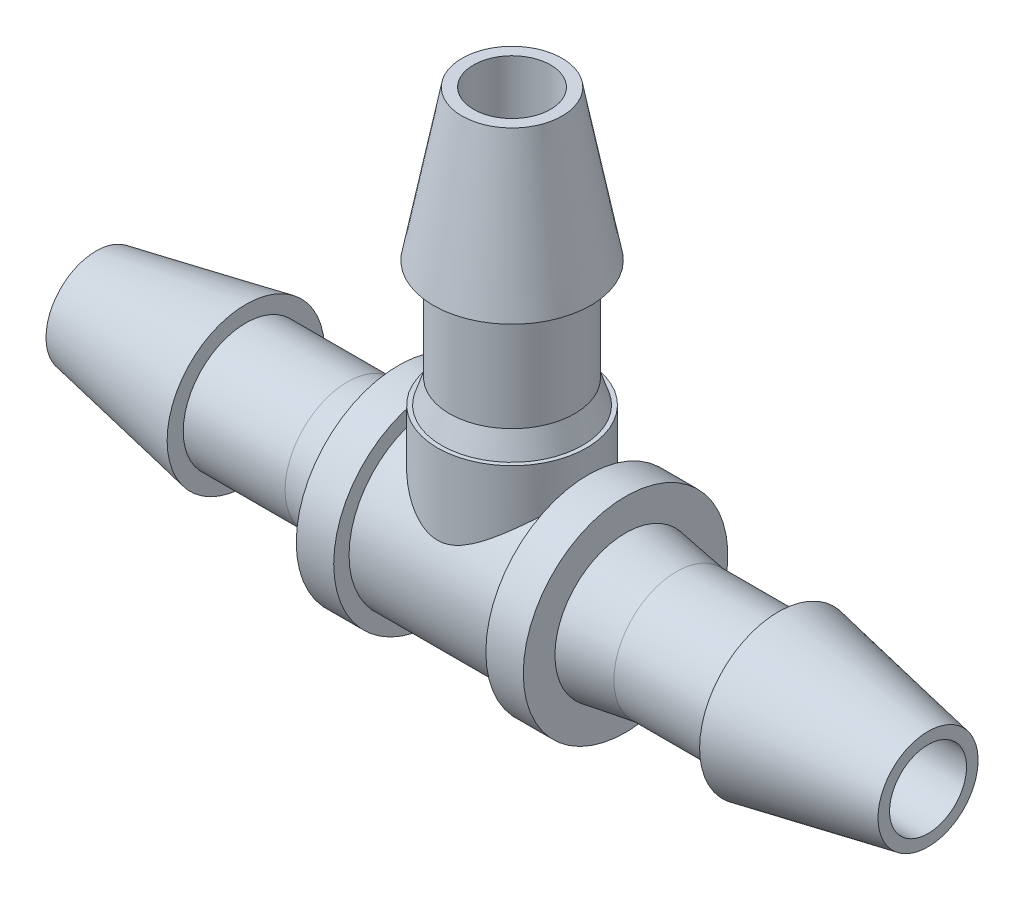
ISO-10303-21;
HEADER;
FILE_DESCRIPTION(('STEP AP214'),'2;1');
FILE_NAME('part.step','',(''),(''),'','','');
FILE_SCHEMA(('AUTOMOTIVE_DESIGN { 1 0 10303 214 1 1 1 1 }'));
ENDSEC;
DATA;
#1=APPLICATION_CONTEXT('core data for automotive mechanical design processes');
#2=APPLICATION_PROTOCOL_DEFINITION('international standard','automotive_design',2000,#1);
#3=PRODUCT_CONTEXT('',#1,'mechanical');
#4=PRODUCT('Part','Part','',(#3));
#5=PRODUCT_RELATED_PRODUCT_CATEGORY('part','',(#4));
#6=PRODUCT_DEFINITION_FORMATION('','',#4);
#7=PRODUCT_DEFINITION_CONTEXT('part definition',#1,'design');
#8=PRODUCT_DEFINITION('design','',#6,#7);
#9=PRODUCT_DEFINITION_SHAPE('','',#8);
#10=(LENGTH_UNIT() NAMED_UNIT(*) SI_UNIT(.MILLI.,.METRE.));
#11=(NAMED_UNIT(*) PLANE_ANGLE_UNIT() SI_UNIT($,.RADIAN.));
#12=(NAMED_UNIT(*) SI_UNIT($,.STERADIAN.) SOLID_ANGLE_UNIT());
#13=UNCERTAINTY_MEASURE_WITH_UNIT(LENGTH_MEASURE(1.E-05),#10,'distance_accuracy_value','');
#14=(GEOMETRIC_REPRESENTATION_CONTEXT(3) GLOBAL_UNCERTAINTY_ASSIGNED_CONTEXT((#13)) GLOBAL_UNIT_ASSIGNED_CONTEXT((#10,
#11,#12)) REPRESENTATION_CONTEXT('',''));
#15=CARTESIAN_POINT('',(0.,0.,0.));
#16=DIRECTION('',(0.,0.,1.));
#17=DIRECTION('',(1.,0.,0.));
#18=AXIS2_PLACEMENT_3D('',#15,#16,#17);
#19=CARTESIAN_POINT('',(0.,0.,0.));
#20=DIRECTION('',(0.,1.,0.));
#21=DIRECTION('',(0.,0.,1.));
#22=AXIS2_PLACEMENT_3D('',#19,#20,#21);
#23=CYLINDRICAL_SURFACE('',#22,2.26218496);
#24=CARTESIAN_POINT('',(0.,3.7855652,0.));
#25=DIRECTION('',(0.,1.,0.));
#26=DIRECTION('',(0.,0.,1.));
#27=AXIS2_PLACEMENT_3D('',#24,#25,#26);
#28=CIRCLE('',#27,2.26218496);
#29=CARTESIAN_POINT('',(0.,3.7855652,2.26218496));
#30=VERTEX_POINT('',#29);
#31=EDGE_CURVE('E114',#30,#30,#28,.T.);
#32=ORIENTED_EDGE('',*,*,#31,.F.);
#33=EDGE_LOOP('',(#32));
#34=FACE_BOUND('',#33,.T.);
#35=CARTESIAN_POINT('',(0.,1.35762128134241,2.26218496));
#36=CARTESIAN_POINT('',(-0.0759142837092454,1.3576411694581,2.26217795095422));
#37=CARTESIAN_POINT('',(-0.151930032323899,1.36413499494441,2.25831367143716));
#38=CARTESIAN_POINT('',(-0.301373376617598,1.38868641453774,2.24329043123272));
#39=CARTESIAN_POINT('',(-0.374792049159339,1.40678043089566,2.23210849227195));
#40=CARTESIAN_POINT('',(-0.547563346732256,1.46070059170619,2.19735250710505));
#41=CARTESIAN_POINT('',(-0.644888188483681,1.50078022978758,2.17054888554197));
#42=CARTESIAN_POINT('',(-0.831587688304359,1.58993536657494,2.10612535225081));
#43=CARTESIAN_POINT('',(-0.920931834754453,1.63904336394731,2.06846607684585));
#44=CARTESIAN_POINT('',(-1.07187669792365,1.7289729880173,1.99345126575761));
#45=CARTESIAN_POINT('',(-1.13501322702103,1.76897866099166,1.95816412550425));
#46=CARTESIAN_POINT('',(-1.25727781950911,1.84980547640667,1.88200080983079));
#47=CARTESIAN_POINT('',(-1.31640389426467,1.89062701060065,1.84112189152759));
#48=CARTESIAN_POINT('',(-1.48769304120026,2.01242765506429,1.71023245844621));
#49=CARTESIAN_POINT('',(-1.59404864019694,2.09292188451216,1.61182859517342));
#50=CARTESIAN_POINT('',(-1.76697273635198,2.22781637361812,1.41712140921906));
#51=CARTESIAN_POINT('',(-1.83712619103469,2.28403447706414,1.32523557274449));
#52=CARTESIAN_POINT('',(-1.96425266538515,2.38747742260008,1.12821956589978));
#53=CARTESIAN_POINT('',(-2.0212475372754,2.4347171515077,1.02311180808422));
#54=CARTESIAN_POINT('',(-2.11022004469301,2.50912136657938,0.821171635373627));
#55=CARTESIAN_POINT('',(-2.14485903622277,2.53837215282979,0.726287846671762));
#56=CARTESIAN_POINT('',(-2.20151736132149,2.5864234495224,0.530269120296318));
#57=CARTESIAN_POINT('',(-2.22354414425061,2.60523012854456,0.429137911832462));
#58=CARTESIAN_POINT('',(-2.25361012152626,2.63093760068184,0.222792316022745));
#59=CARTESIAN_POINT('',(-2.26158235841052,2.63778139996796,0.117560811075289));
#60=CARTESIAN_POINT('',(-2.26272111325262,2.63875762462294,-0.0930399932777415));
#61=CARTESIAN_POINT('',(-2.25588928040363,2.63289146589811,-0.198409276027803));
#62=CARTESIAN_POINT('',(-2.22904061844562,2.6099262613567,-0.39773598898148));
#63=CARTESIAN_POINT('',(-2.21008244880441,2.5937294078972,-0.491946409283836));
#64=CARTESIAN_POINT('',(-2.16112811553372,2.55214505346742,-0.675290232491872));
#65=CARTESIAN_POINT('',(-2.13113014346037,2.52675604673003,-0.7644228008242));
#66=CARTESIAN_POINT('',(-2.05884270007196,2.46608002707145,-0.942651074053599));
#67=CARTESIAN_POINT('',(-2.01579145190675,2.4301867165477,-1.0312275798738));
#68=CARTESIAN_POINT('',(-1.92025715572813,2.35155154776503,-1.19979114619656));
#69=CARTESIAN_POINT('',(-1.86776726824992,2.30880472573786,-1.27977191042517));
#70=CARTESIAN_POINT('',(-1.72630706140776,2.19559138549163,-1.46883026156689));
#71=CARTESIAN_POINT('',(-1.63226885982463,2.12199846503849,-1.5723034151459));
#72=CARTESIAN_POINT('',(-1.4800238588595,2.00810453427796,-1.71224557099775));
#73=CARTESIAN_POINT('',(-1.42731385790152,1.96948862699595,-1.75640904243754));
#74=CARTESIAN_POINT('',(-1.31825110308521,1.8919449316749,-1.83967163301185));
#75=CARTESIAN_POINT('',(-1.26189946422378,1.85301724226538,-1.87877229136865));
#76=CARTESIAN_POINT('',(-1.1114895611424,1.7532024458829,-1.97331772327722));
#77=CARTESIAN_POINT('',(-1.01466921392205,1.69280059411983,-2.02493075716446));
#78=CARTESIAN_POINT('',(-0.811132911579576,1.57921648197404,-2.11467912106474));
#79=CARTESIAN_POINT('',(-0.704448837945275,1.52601224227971,-2.15285608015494));
#80=CARTESIAN_POINT('',(-0.525107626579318,1.45435210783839,-2.20148973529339));
#81=CARTESIAN_POINT('',(-0.45600178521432,1.43052377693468,-2.21692102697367));
#82=CARTESIAN_POINT('',(-0.314283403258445,1.39186551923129,-2.24139524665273));
#83=CARTESIAN_POINT('',(-0.241680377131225,1.37701251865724,-2.2504545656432));
#84=CARTESIAN_POINT('',(-0.0936405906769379,1.3588571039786,-2.26147220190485));
#85=CARTESIAN_POINT('',(-0.0181822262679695,1.35567629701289,-2.26335576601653));
#86=CARTESIAN_POINT('',(0.132034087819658,1.36195215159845,-2.25958143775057));
#87=CARTESIAN_POINT('',(0.20679138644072,1.37141957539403,-2.25391712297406));
#88=CARTESIAN_POINT('',(0.366331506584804,1.40361815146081,-2.23402615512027));
#89=CARTESIAN_POINT('',(0.450502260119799,1.42842682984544,-2.2184439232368));
#90=CARTESIAN_POINT('',(0.613389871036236,1.48780502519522,-2.17906184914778));
#91=CARTESIAN_POINT('',(0.692085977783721,1.52240940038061,-2.15523259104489));
#92=CARTESIAN_POINT('',(0.831713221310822,1.5911714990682,-2.1048299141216));
#93=CARTESIAN_POINT('',(0.893458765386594,1.62449590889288,-2.07932400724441));
#94=CARTESIAN_POINT('',(1.01343670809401,1.69345414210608,-2.02356190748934));
#95=CARTESIAN_POINT('',(1.07166681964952,1.72908943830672,-1.99330266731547));
#96=CARTESIAN_POINT('',(1.24151960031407,1.8376167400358,-1.89557927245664));
#97=CARTESIAN_POINT('',(1.34823703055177,1.9120936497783,-1.82119447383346));
#98=CARTESIAN_POINT('',(1.5536439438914,2.06200401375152,-1.64998009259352));
#99=CARTESIAN_POINT('',(1.65164648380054,2.13729255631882,-1.55219934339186));
#100=CARTESIAN_POINT('',(1.83057616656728,2.27840859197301,-1.33640744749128));
#101=CARTESIAN_POINT('',(1.91155135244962,2.34426253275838,-1.2184549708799));
#102=CARTESIAN_POINT('',(2.03069883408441,2.44256523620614,-1.00202322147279));
#103=CARTESIAN_POINT('',(2.07440968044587,2.479093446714,-0.908443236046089));
#104=CARTESIAN_POINT('',(2.14935518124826,2.54213466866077,-0.713202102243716));
#105=CARTESIAN_POINT('',(2.18059866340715,2.56865476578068,-0.611546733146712));
#106=CARTESIAN_POINT('',(2.22884232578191,2.60973417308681,-0.401741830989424));
#107=CARTESIAN_POINT('',(2.24574281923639,2.62420975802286,-0.293552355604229));
#108=CARTESIAN_POINT('',(2.26359817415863,2.63950550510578,-0.0749133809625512));
#109=CARTESIAN_POINT('',(2.26456077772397,2.64033229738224,0.0355349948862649));
#110=CARTESIAN_POINT('',(2.25125012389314,2.62892660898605,0.242865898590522));
#111=CARTESIAN_POINT('',(2.23859320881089,2.61807954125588,0.339937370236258));
#112=CARTESIAN_POINT('',(2.20134841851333,2.58630551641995,0.530029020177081));
#113=CARTESIAN_POINT('',(2.17675850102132,2.56537683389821,0.623048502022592));
#114=CARTESIAN_POINT('',(2.11607702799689,2.51408955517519,0.805760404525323));
#115=CARTESIAN_POINT('',(2.07966321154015,2.48346743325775,0.895269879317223));
#116=CARTESIAN_POINT('',(1.99720723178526,2.41483990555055,1.06662985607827));
#117=CARTESIAN_POINT('',(1.95116183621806,2.37683202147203,1.1484777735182));
#118=CARTESIAN_POINT('',(1.82691924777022,2.27571933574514,1.34109738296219));
#119=CARTESIAN_POINT('',(1.74387114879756,2.20929957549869,1.44700610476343));
#120=CARTESIAN_POINT('',(1.56310677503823,2.06956063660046,1.64068247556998));
#121=CARTESIAN_POINT('',(1.46534009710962,1.99621808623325,1.72838522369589));
#122=CARTESIAN_POINT('',(1.30794270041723,1.88479844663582,1.84693864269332));
#123=CARTESIAN_POINT('',(1.25308071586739,1.84703913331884,1.88459869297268));
#124=CARTESIAN_POINT('',(1.13987146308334,1.77218209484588,1.95515430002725));
#125=CARTESIAN_POINT('',(1.08152262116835,1.73508467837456,1.98804768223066));
#126=CARTESIAN_POINT('',(0.961384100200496,1.66285735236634,2.04883915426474));
#127=CARTESIAN_POINT('',(0.899605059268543,1.62772197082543,2.07675166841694));
#128=CARTESIAN_POINT('',(0.772216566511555,1.56093444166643,2.1274052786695));
#129=CARTESIAN_POINT('',(0.706611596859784,1.52927833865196,2.15015227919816));
#130=CARTESIAN_POINT('',(0.569049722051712,1.47069659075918,2.19065604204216));
#131=CARTESIAN_POINT('',(0.496955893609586,1.44395741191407,2.20822727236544));
#132=CARTESIAN_POINT('',(0.3487501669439,1.39994137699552,2.23639924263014));
#133=CARTESIAN_POINT('',(0.272656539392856,1.38262500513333,2.24702913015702));
#134=CARTESIAN_POINT('',(0.163108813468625,1.36700742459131,2.25653101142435));
#135=CARTESIAN_POINT('',(0.130632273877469,1.36350533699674,2.25864524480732));
#136=CARTESIAN_POINT('',(0.0654434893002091,1.35880762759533,2.26147394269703));
#137=CARTESIAN_POINT('',(0.0327311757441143,1.35761270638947,2.2621879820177));
#138=CARTESIAN_POINT('',(0.,1.35762128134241,2.26218496));
#139=B_SPLINE_CURVE_WITH_KNOTS('',3,(#35,#36,#37,#38,#39,#40,#41,#42,#43,#44,#45,#46,#47,#48,
#49,#50,#51,#52,#53,#54,#55,#56,#57,#58,#59,#60,#61,#62,#63,#64,#65,#66,#67,#68,#69,#70,#71,#72,
#73,#74,#75,#76,#77,#78,#79,#80,#81,#82,#83,#84,#85,#86,#87,#88,#89,#90,#91,#92,#93,#94,#95,#96,
#97,#98,#99,#100,#101,#102,#103,#104,#105,#106,#107,#108,#109,#110,#111,#112,#113,#114,#115,
#116,#117,#118,#119,#120,#121,#122,#123,#124,#125,#126,#127,#128,#129,#130,#131,#132,#133,#134,
#135,#136,#137,#138),.UNSPECIFIED.,.T.,.F.,(4,2,2,2,2,2,2,2,2,2,2,2,2,2,2,2,2,2,2,2,2,2,2,2,2,2,
2,2,2,2,2,2,2,2,2,2,2,2,2,2,2,2,2,2,2,2,2,2,2,2,2,4),(0.,0.227594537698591,0.455907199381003,
0.779912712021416,1.10510820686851,1.35276864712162,1.60055100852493,2.09504156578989,
2.47935092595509,2.86301740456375,3.1772012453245,3.49119932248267,3.80668932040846,
4.12214417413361,4.413244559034,4.70439265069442,5.01770157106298,5.33123844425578,
5.80251049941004,6.03893442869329,6.27528630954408,6.64999903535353,7.02354034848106,
7.246993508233,7.46986974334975,7.69506153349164,7.92044505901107,8.18632445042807,
8.45316213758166,8.67683378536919,8.90064941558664,9.34852063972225,9.81923201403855,
10.2885968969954,10.6160101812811,10.9431912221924,11.2726280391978,11.6019048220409,
11.8960119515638,12.1901694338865,12.4931323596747,12.7961971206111,13.2440505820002,
13.6934741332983,13.9228237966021,14.1522777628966,14.3810560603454,14.6095715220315,
14.8454898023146,15.0804109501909,15.1785107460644,15.276640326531),.UNSPECIFIED.);
#140=CARTESIAN_POINT('',(0.,1.35762128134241,2.26218496));
#141=VERTEX_POINT('',#140);
#142=EDGE_CURVE('E11',#141,#141,#139,.T.);
#143=ORIENTED_EDGE('',*,*,#142,.F.);
#144=EDGE_LOOP('',(#143));
#145=FACE_BOUND('',#144,.T.);
#146=ADVANCED_FACE('F43',(#34,#145),#23,.T.);
#147=CARTESIAN_POINT('',(0.,0.,0.));
#148=DIRECTION('',(-1.,0.,0.));
#149=DIRECTION('',(0.,0.,1.));
#150=AXIS2_PLACEMENT_3D('',#147,#148,#149);
#151=CYLINDRICAL_SURFACE('',#150,1.1684);
#152=CARTESIAN_POINT('',(0.,0.,0.));
#153=DIRECTION('',(-0.70710678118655,0.707106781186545,0.));
#154=DIRECTION('',(0.707106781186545,0.70710678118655,0.));
#155=AXIS2_PLACEMENT_3D('',#152,#153,#154);
#156=ELLIPSE('',#155,1.65236712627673,1.1684);
#157=CARTESIAN_POINT('',(0.,0.,1.1684));
#158=VERTEX_POINT('',#157);
#159=CARTESIAN_POINT('',(0.,0.,-1.1684));
#160=VERTEX_POINT('',#159);
#161=EDGE_CURVE('E64',#158,#160,#156,.T.);
#162=ORIENTED_EDGE('',*,*,#161,.T.);
#163=CARTESIAN_POINT('',(0.,0.,0.));
#164=DIRECTION('',(0.707106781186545,0.70710678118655,0.));
#165=DIRECTION('',(-0.70710678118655,0.707106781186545,0.));
#166=AXIS2_PLACEMENT_3D('',#163,#164,#165);
#167=ELLIPSE('',#166,1.65236712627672,1.1684);
#168=EDGE_CURVE('E62',#160,#158,#167,.T.);
#169=ORIENTED_EDGE('',*,*,#168,.T.);
#170=EDGE_LOOP('',(#162,#169));
#171=FACE_BOUND('',#170,.T.);
#172=CARTESIAN_POINT('',(12.6238,0.,0.));
#173=DIRECTION('',(-1.,0.,0.));
#174=DIRECTION('',(0.,0.,1.));
#175=AXIS2_PLACEMENT_3D('',#172,#173,#174);
#176=CIRCLE('',#175,1.1684);
#177=CARTESIAN_POINT('',(12.6238,0.,1.1684));
#178=VERTEX_POINT('',#177);
#179=EDGE_CURVE('E138',#178,#178,#176,.T.);
#180=ORIENTED_EDGE('',*,*,#179,.F.);
#181=EDGE_LOOP('',(#180));
#182=FACE_BOUND('',#181,.T.);
#183=CARTESIAN_POINT('',(-12.6238,0.,0.));
#184=DIRECTION('',(1.,0.,0.));
#185=DIRECTION('',(0.,0.,1.));
#186=AXIS2_PLACEMENT_3D('',#183,#184,#185);
#187=CIRCLE('',#186,1.1684);
#188=CARTESIAN_POINT('',(-12.6238,0.,1.1684));
#189=VERTEX_POINT('',#188);
#190=EDGE_CURVE('E68',#189,#189,#187,.T.);
#191=ORIENTED_EDGE('',*,*,#190,.F.);
#192=EDGE_LOOP('',(#191));
#193=FACE_BOUND('',#192,.T.);
#194=ADVANCED_FACE('F45',(#171,#182,#193),#151,.F.);
#195=CARTESIAN_POINT('',(0.,0.,0.));
#196=DIRECTION('',(-1.,0.,0.));
#197=DIRECTION('',(0.,0.,1.));
#198=AXIS2_PLACEMENT_3D('',#195,#196,#197);
#199=CYLINDRICAL_SURFACE('',#198,2.638298);
#200=CARTESIAN_POINT('',(2.308352,0.,0.));
#201=DIRECTION('',(-1.,0.,0.));
#202=DIRECTION('',(0.,0.,1.));
#203=AXIS2_PLACEMENT_3D('',#200,#201,#202);
#204=CIRCLE('',#203,2.638298);
#205=CARTESIAN_POINT('',(2.308352,0.,2.638298));
#206=VERTEX_POINT('',#205);
#207=EDGE_CURVE('E56',#206,#206,#204,.T.);
#208=ORIENTED_EDGE('',*,*,#207,.T.);
#209=EDGE_LOOP('',(#208));
#210=FACE_BOUND('',#209,.T.);
#211=ORIENTED_EDGE('',*,*,#142,.T.);
#212=EDGE_LOOP('',(#211));
#213=FACE_BOUND('',#212,.T.);
#214=CARTESIAN_POINT('',(-2.308352,0.,0.));
#215=DIRECTION('',(1.,0.,0.));
#216=DIRECTION('',(0.,0.,1.));
#217=AXIS2_PLACEMENT_3D('',#214,#215,#216);
#218=CIRCLE('',#217,2.638298);
#219=CARTESIAN_POINT('',(-2.308352,0.,2.638298));
#220=VERTEX_POINT('',#219);
#221=EDGE_CURVE('E106',#220,#220,#218,.T.);
#222=ORIENTED_EDGE('',*,*,#221,.T.);
#223=EDGE_LOOP('',(#222));
#224=FACE_BOUND('',#223,.T.);
#225=ADVANCED_FACE('F173',(#210,#213,#224),#199,.T.);
#226=CARTESIAN_POINT('',(2.308352,3.10388,0.));
#227=DIRECTION('',(1.,0.,0.));
#228=DIRECTION('',(0.,0.,-1.));
#229=AXIS2_PLACEMENT_3D('',#226,#227,#228);
#230=PLANE('',#229);
#231=ORIENTED_EDGE('',*,*,#207,.F.);
#232=EDGE_LOOP('',(#231));
#233=FACE_BOUND('',#232,.T.);
#234=CARTESIAN_POINT('',(2.308352,0.,0.));
#235=DIRECTION('',(-1.,0.,0.));
#236=DIRECTION('',(0.,0.,1.));
#237=AXIS2_PLACEMENT_3D('',#234,#235,#236);
#238=CIRCLE('',#237,3.10388);
#239=CARTESIAN_POINT('',(2.308352,0.,3.10388));
#240=VERTEX_POINT('',#239);
#241=EDGE_CURVE('E166',#240,#240,#238,.T.);
#242=ORIENTED_EDGE('',*,*,#241,.T.);
#243=EDGE_LOOP('',(#242));
#244=FACE_BOUND('',#243,.T.);
#245=ADVANCED_FACE('F176',(#233,#244),#230,.F.);
#246=CARTESIAN_POINT('',(0.,0.,0.));
#247=DIRECTION('',(-1.,0.,0.));
#248=DIRECTION('',(0.,0.,1.));
#249=AXIS2_PLACEMENT_3D('',#246,#247,#248);
#250=CYLINDRICAL_SURFACE('',#249,3.10388);
#251=ORIENTED_EDGE('',*,*,#241,.F.);
#252=EDGE_LOOP('',(#251));
#253=FACE_BOUND('',#252,.T.);
#254=CARTESIAN_POINT('',(3.444494,0.,0.));
#255=DIRECTION('',(-1.,0.,0.));
#256=DIRECTION('',(0.,0.,1.));
#257=AXIS2_PLACEMENT_3D('',#254,#255,#256);
#258=CIRCLE('',#257,3.10388);
#259=CARTESIAN_POINT('',(3.444494,0.,3.10388));
#260=VERTEX_POINT('',#259);
#261=EDGE_CURVE('E162',#260,#260,#258,.T.);
#262=ORIENTED_EDGE('',*,*,#261,.T.);
#263=EDGE_LOOP('',(#262));
#264=FACE_BOUND('',#263,.T.);
#265=ADVANCED_FACE('F179',(#253,#264),#250,.T.);
#266=CARTESIAN_POINT('',(3.444494,2.143125,0.));
#267=DIRECTION('',(-1.,0.,0.));
#268=DIRECTION('',(0.,0.,1.));
#269=AXIS2_PLACEMENT_3D('',#266,#267,#268);
#270=PLANE('',#269);
#271=ORIENTED_EDGE('',*,*,#261,.F.);
#272=EDGE_LOOP('',(#271));
#273=FACE_BOUND('',#272,.T.);
#274=CARTESIAN_POINT('',(3.444494,0.,0.));
#275=DIRECTION('',(-1.,0.,0.));
#276=DIRECTION('',(0.,0.,1.));
#277=AXIS2_PLACEMENT_3D('',#274,#275,#276);
#278=CIRCLE('',#277,2.143125);
#279=CARTESIAN_POINT('',(3.444494,0.,2.143125));
#280=VERTEX_POINT('',#279);
#281=EDGE_CURVE('E158',#280,#280,#278,.T.);
#282=ORIENTED_EDGE('',*,*,#281,.T.);
#283=EDGE_LOOP('',(#282));
#284=FACE_BOUND('',#283,.T.);
#285=ADVANCED_FACE('F185',(#273,#284),#270,.F.);
#286=CARTESIAN_POINT('',(4.98940666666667,0.,0.));
#287=DIRECTION('',(-1.,0.,0.));
#288=DIRECTION('',(0.,0.,1.));
#289=AXIS2_PLACEMENT_3D('',#286,#287,#288);
#290=CONICAL_SURFACE('',#289,1.89865,0.156943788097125);
#291=ORIENTED_EDGE('',*,*,#281,.F.);
#292=EDGE_LOOP('',(#291));
#293=FACE_BOUND('',#292,.T.);
#294=CARTESIAN_POINT('',(4.98940666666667,0.,0.));
#295=DIRECTION('',(-1.,0.,0.));
#296=DIRECTION('',(0.,0.,1.));
#297=AXIS2_PLACEMENT_3D('',#294,#295,#296);
#298=CIRCLE('',#297,1.89865);
#299=CARTESIAN_POINT('',(4.98940666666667,0.,1.89865));
#300=VERTEX_POINT('',#299);
#301=EDGE_CURVE('E154',#300,#300,#298,.T.);
#302=ORIENTED_EDGE('',*,*,#301,.T.);
#303=EDGE_LOOP('',(#302));
#304=FACE_BOUND('',#303,.T.);
#305=ADVANCED_FACE('F191',(#293,#304),#290,.T.);
#306=CARTESIAN_POINT('',(0.,0.,0.));
#307=DIRECTION('',(-1.,0.,0.));
#308=DIRECTION('',(0.,0.,1.));
#309=AXIS2_PLACEMENT_3D('',#306,#307,#308);
#310=CYLINDRICAL_SURFACE('',#309,1.89865);
#311=ORIENTED_EDGE('',*,*,#301,.F.);
#312=EDGE_LOOP('',(#311));
#313=FACE_BOUND('',#312,.T.);
#314=CARTESIAN_POINT('',(8.079232,0.,0.));
#315=DIRECTION('',(-1.,0.,0.));
#316=DIRECTION('',(0.,0.,1.));
#317=AXIS2_PLACEMENT_3D('',#314,#315,#316);
#318=CIRCLE('',#317,1.89865);
#319=CARTESIAN_POINT('',(8.079232,0.,1.89865));
#320=VERTEX_POINT('',#319);
#321=EDGE_CURVE('E150',#320,#320,#318,.T.);
#322=ORIENTED_EDGE('',*,*,#321,.T.);
#323=EDGE_LOOP('',(#322));
#324=FACE_BOUND('',#323,.T.);
#325=ADVANCED_FACE('F197',(#313,#324),#310,.T.);
#326=CARTESIAN_POINT('',(8.079232,2.3876,0.));
#327=DIRECTION('',(1.,0.,0.));
#328=DIRECTION('',(0.,0.,-1.));
#329=AXIS2_PLACEMENT_3D('',#326,#327,#328);
#330=PLANE('',#329);
#331=ORIENTED_EDGE('',*,*,#321,.F.);
#332=EDGE_LOOP('',(#331));
#333=FACE_BOUND('',#332,.T.);
#334=CARTESIAN_POINT('',(8.079232,0.,0.));
#335=DIRECTION('',(-1.,0.,0.));
#336=DIRECTION('',(0.,0.,1.));
#337=AXIS2_PLACEMENT_3D('',#334,#335,#336);
#338=CIRCLE('',#337,2.3876);
#339=CARTESIAN_POINT('',(8.079232,0.,2.3876));
#340=VERTEX_POINT('',#339);
#341=EDGE_CURVE('E146',#340,#340,#338,.T.);
#342=ORIENTED_EDGE('',*,*,#341,.T.);
#343=EDGE_LOOP('',(#342));
#344=FACE_BOUND('',#343,.T.);
#345=ADVANCED_FACE('F203',(#333,#344),#330,.F.);
#346=CARTESIAN_POINT('',(12.6238,0.,0.));
#347=DIRECTION('',(-1.,0.,0.));
#348=DIRECTION('',(0.,0.,1.));
#349=AXIS2_PLACEMENT_3D('',#346,#347,#348);
#350=CONICAL_SURFACE('',#349,1.51892,0.188868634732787);
#351=ORIENTED_EDGE('',*,*,#341,.F.);
#352=EDGE_LOOP('',(#351));
#353=FACE_BOUND('',#352,.T.);
#354=CARTESIAN_POINT('',(12.6238,0.,0.));
#355=DIRECTION('',(-1.,0.,0.));
#356=DIRECTION('',(0.,0.,1.));
#357=AXIS2_PLACEMENT_3D('',#354,#355,#356);
#358=CIRCLE('',#357,1.51892);
#359=CARTESIAN_POINT('',(12.6238,0.,1.51892));
#360=VERTEX_POINT('',#359);
#361=EDGE_CURVE('E142',#360,#360,#358,.T.);
#362=ORIENTED_EDGE('',*,*,#361,.T.);
#363=EDGE_LOOP('',(#362));
#364=FACE_BOUND('',#363,.T.);
#365=ADVANCED_FACE('F209',(#353,#364),#350,.T.);
#366=CARTESIAN_POINT('',(12.6238,1.1684,0.));
#367=DIRECTION('',(-1.,0.,0.));
#368=DIRECTION('',(0.,0.,1.));
#369=AXIS2_PLACEMENT_3D('',#366,#367,#368);
#370=PLANE('',#369);
#371=ORIENTED_EDGE('',*,*,#361,.F.);
#372=EDGE_LOOP('',(#371));
#373=FACE_BOUND('',#372,.T.);
#374=ORIENTED_EDGE('',*,*,#179,.T.);
#375=EDGE_LOOP('',(#374));
#376=FACE_BOUND('',#375,.T.);
#377=ADVANCED_FACE('F215',(#373,#376),#370,.F.);
#378=CARTESIAN_POINT('',(-2.13518496,3.7855652,0.));
#379=DIRECTION('',(0.,1.,0.));
#380=DIRECTION('',(0.,0.,1.));
#381=AXIS2_PLACEMENT_3D('',#378,#379,#380);
#382=PLANE('',#381);
#383=ORIENTED_EDGE('',*,*,#31,.T.);
#384=EDGE_LOOP('',(#383));
#385=FACE_BOUND('',#384,.T.);
#386=CARTESIAN_POINT('',(0.,3.7855652,0.));
#387=DIRECTION('',(0.,1.,0.));
#388=DIRECTION('',(0.,0.,1.));
#389=AXIS2_PLACEMENT_3D('',#386,#387,#388);
#390=CIRCLE('',#389,2.13518496);
#391=CARTESIAN_POINT('',(0.,3.7855652,2.13518496));
#392=VERTEX_POINT('',#391);
#393=EDGE_CURVE('E118',#392,#392,#390,.T.);
#394=ORIENTED_EDGE('',*,*,#393,.F.);
#395=EDGE_LOOP('',(#394));
#396=FACE_BOUND('',#395,.T.);
#397=ADVANCED_FACE('F221',(#385,#396),#382,.T.);
#398=CARTESIAN_POINT('',(0.,4.50172666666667,0.));
#399=DIRECTION('',(0.,-1.,0.));
#400=DIRECTION('',(0.,0.,-1.));
#401=AXIS2_PLACEMENT_3D('',#398,#399,#400);
#402=CONICAL_SURFACE('',#401,1.89865,0.319001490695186);
#403=ORIENTED_EDGE('',*,*,#393,.T.);
#404=EDGE_LOOP('',(#403));
#405=FACE_BOUND('',#404,.T.);
#406=CARTESIAN_POINT('',(0.,4.50172666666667,0.));
#407=DIRECTION('',(0.,1.,0.));
#408=DIRECTION('',(0.,0.,1.));
#409=AXIS2_PLACEMENT_3D('',#406,#407,#408);
#410=CIRCLE('',#409,1.89865);
#411=CARTESIAN_POINT('',(0.,4.50172666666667,1.89865));
#412=VERTEX_POINT('',#411);
#413=EDGE_CURVE('E122',#412,#412,#410,.T.);
#414=ORIENTED_EDGE('',*,*,#413,.F.);
#415=EDGE_LOOP('',(#414));
#416=FACE_BOUND('',#415,.T.);
#417=ADVANCED_FACE('F253',(#405,#416),#402,.T.);
#418=CARTESIAN_POINT('',(0.,0.,0.));
#419=DIRECTION('',(0.,1.,0.));
#420=DIRECTION('',(0.,0.,1.));
#421=AXIS2_PLACEMENT_3D('',#418,#419,#420);
#422=CYLINDRICAL_SURFACE('',#421,1.89865);
#423=ORIENTED_EDGE('',*,*,#413,.T.);
#424=EDGE_LOOP('',(#423));
#425=FACE_BOUND('',#424,.T.);
#426=CARTESIAN_POINT('',(0.,7.591552,0.));
#427=DIRECTION('',(0.,1.,0.));
#428=DIRECTION('',(0.,0.,1.));
#429=AXIS2_PLACEMENT_3D('',#426,#427,#428);
#430=CIRCLE('',#429,1.89865);
#431=CARTESIAN_POINT('',(0.,7.591552,1.89865));
#432=VERTEX_POINT('',#431);
#433=EDGE_CURVE('E126',#432,#432,#430,.T.);
#434=ORIENTED_EDGE('',*,*,#433,.F.);
#435=EDGE_LOOP('',(#434));
#436=FACE_BOUND('',#435,.T.);
#437=ADVANCED_FACE('F257',(#425,#436),#422,.T.);
#438=CARTESIAN_POINT('',(-2.3876,7.591552,0.));
#439=DIRECTION('',(0.,-1.,0.));
#440=DIRECTION('',(0.,0.,-1.));
#441=AXIS2_PLACEMENT_3D('',#438,#439,#440);
#442=PLANE('',#441);
#443=ORIENTED_EDGE('',*,*,#433,.T.);
#444=EDGE_LOOP('',(#443));
#445=FACE_BOUND('',#444,.T.);
#446=CARTESIAN_POINT('',(0.,7.591552,0.));
#447=DIRECTION('',(0.,1.,0.));
#448=DIRECTION('',(0.,0.,1.));
#449=AXIS2_PLACEMENT_3D('',#446,#447,#448);
#450=CIRCLE('',#449,2.3876);
#451=CARTESIAN_POINT('',(0.,7.591552,2.3876));
#452=VERTEX_POINT('',#451);
#453=EDGE_CURVE('E130',#452,#452,#450,.T.);
#454=ORIENTED_EDGE('',*,*,#453,.F.);
#455=EDGE_LOOP('',(#454));
#456=FACE_BOUND('',#455,.T.);
#457=ADVANCED_FACE('F261',(#445,#456),#442,.T.);
#458=CARTESIAN_POINT('',(0.,12.13612,0.));
#459=DIRECTION('',(0.,-1.,0.));
#460=DIRECTION('',(0.,0.,-1.));
#461=AXIS2_PLACEMENT_3D('',#458,#459,#460);
#462=CONICAL_SURFACE('',#461,1.51892,0.188868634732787);
#463=ORIENTED_EDGE('',*,*,#453,.T.);
#464=EDGE_LOOP('',(#463));
#465=FACE_BOUND('',#464,.T.);
#466=CARTESIAN_POINT('',(0.,12.13612,0.));
#467=DIRECTION('',(0.,1.,0.));
#468=DIRECTION('',(0.,0.,1.));
#469=AXIS2_PLACEMENT_3D('',#466,#467,#468);
#470=CIRCLE('',#469,1.51892);
#471=CARTESIAN_POINT('',(0.,12.13612,1.51892));
#472=VERTEX_POINT('',#471);
#473=EDGE_CURVE('E134',#472,#472,#470,.T.);
#474=ORIENTED_EDGE('',*,*,#473,.F.);
#475=EDGE_LOOP('',(#474));
#476=FACE_BOUND('',#475,.T.);
#477=ADVANCED_FACE('F265',(#465,#476),#462,.T.);
#478=CARTESIAN_POINT('',(-1.1684,12.13612,0.));
#479=DIRECTION('',(0.,1.,0.));
#480=DIRECTION('',(0.,0.,1.));
#481=AXIS2_PLACEMENT_3D('',#478,#479,#480);
#482=PLANE('',#481);
#483=ORIENTED_EDGE('',*,*,#473,.T.);
#484=EDGE_LOOP('',(#483));
#485=FACE_BOUND('',#484,.T.);
#486=CARTESIAN_POINT('',(0.,12.13612,0.));
#487=DIRECTION('',(0.,1.,0.));
#488=DIRECTION('',(0.,0.,1.));
#489=AXIS2_PLACEMENT_3D('',#486,#487,#488);
#490=CIRCLE('',#489,1.1684);
#491=CARTESIAN_POINT('',(0.,12.13612,1.1684));
#492=VERTEX_POINT('',#491);
#493=EDGE_CURVE('E110',#492,#492,#490,.T.);
#494=ORIENTED_EDGE('',*,*,#493,.F.);
#495=EDGE_LOOP('',(#494));
#496=FACE_BOUND('',#495,.T.);
#497=ADVANCED_FACE('F269',(#485,#496),#482,.T.);
#498=CARTESIAN_POINT('',(0.,0.,0.));
#499=DIRECTION('',(0.,1.,0.));
#500=DIRECTION('',(0.,0.,1.));
#501=AXIS2_PLACEMENT_3D('',#498,#499,#500);
#502=CYLINDRICAL_SURFACE('',#501,1.1684);
#503=ORIENTED_EDGE('',*,*,#161,.F.);
#504=ORIENTED_EDGE('',*,*,#168,.F.);
#505=EDGE_LOOP('',(#503,#504));
#506=FACE_BOUND('',#505,.T.);
#507=ORIENTED_EDGE('',*,*,#493,.T.);
#508=EDGE_LOOP('',(#507));
#509=FACE_BOUND('',#508,.T.);
#510=ADVANCED_FACE('F70',(#506,#509),#502,.F.);
#511=CARTESIAN_POINT('',(-2.30835199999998,-3.10388000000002,0.));
#512=DIRECTION('',(-1.,0.,0.));
#513=DIRECTION('',(0.,0.,-1.));
#514=AXIS2_PLACEMENT_3D('',#511,#512,#513);
#515=PLANE('',#514);
#516=ORIENTED_EDGE('',*,*,#221,.F.);
#517=EDGE_LOOP('',(#516));
#518=FACE_BOUND('',#517,.T.);
#519=CARTESIAN_POINT('',(-2.308352,0.,0.));
#520=DIRECTION('',(1.,0.,0.));
#521=DIRECTION('',(0.,0.,1.));
#522=AXIS2_PLACEMENT_3D('',#519,#520,#521);
#523=CIRCLE('',#522,3.10388);
#524=CARTESIAN_POINT('',(-2.308352,0.,3.10388));
#525=VERTEX_POINT('',#524);
#526=EDGE_CURVE('E102',#525,#525,#523,.T.);
#527=ORIENTED_EDGE('',*,*,#526,.T.);
#528=EDGE_LOOP('',(#527));
#529=FACE_BOUND('',#528,.T.);
#530=ADVANCED_FACE('F306',(#518,#529),#515,.F.);
#531=CARTESIAN_POINT('',(0.,0.,0.));
#532=DIRECTION('',(1.,0.,0.));
#533=DIRECTION('',(0.,0.,1.));
#534=AXIS2_PLACEMENT_3D('',#531,#532,#533);
#535=CYLINDRICAL_SURFACE('',#534,3.10388);
#536=ORIENTED_EDGE('',*,*,#526,.F.);
#537=EDGE_LOOP('',(#536));
#538=FACE_BOUND('',#537,.T.);
#539=CARTESIAN_POINT('',(-3.444494,0.,0.));
#540=DIRECTION('',(1.,0.,0.));
#541=DIRECTION('',(0.,0.,1.));
#542=AXIS2_PLACEMENT_3D('',#539,#540,#541);
#543=CIRCLE('',#542,3.10388);
#544=CARTESIAN_POINT('',(-3.444494,0.,3.10388));
#545=VERTEX_POINT('',#544);
#546=EDGE_CURVE('E98',#545,#545,#543,.T.);
#547=ORIENTED_EDGE('',*,*,#546,.T.);
#548=EDGE_LOOP('',(#547));
#549=FACE_BOUND('',#548,.T.);
#550=ADVANCED_FACE('F310',(#538,#549),#535,.T.);
#551=CARTESIAN_POINT('',(-3.44449399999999,-2.14312500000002,0.));
#552=DIRECTION('',(1.,0.,0.));
#553=DIRECTION('',(0.,0.,1.));
#554=AXIS2_PLACEMENT_3D('',#551,#552,#553);
#555=PLANE('',#554);
#556=ORIENTED_EDGE('',*,*,#546,.F.);
#557=EDGE_LOOP('',(#556));
#558=FACE_BOUND('',#557,.T.);
#559=CARTESIAN_POINT('',(-3.444494,0.,0.));
#560=DIRECTION('',(1.,0.,0.));
#561=DIRECTION('',(0.,0.,1.));
#562=AXIS2_PLACEMENT_3D('',#559,#560,#561);
#563=CIRCLE('',#562,2.143125);
#564=CARTESIAN_POINT('',(-3.444494,0.,2.143125));
#565=VERTEX_POINT('',#564);
#566=EDGE_CURVE('E94',#565,#565,#563,.T.);
#567=ORIENTED_EDGE('',*,*,#566,.T.);
#568=EDGE_LOOP('',(#567));
#569=FACE_BOUND('',#568,.T.);
#570=ADVANCED_FACE('F318',(#558,#569),#555,.F.);
#571=CARTESIAN_POINT('',(-4.98940666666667,0.,0.));
#572=DIRECTION('',(1.,0.,0.));
#573=DIRECTION('',(0.,0.,1.));
#574=AXIS2_PLACEMENT_3D('',#571,#572,#573);
#575=CONICAL_SURFACE('',#574,1.89865,0.156943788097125);
#576=ORIENTED_EDGE('',*,*,#566,.F.);
#577=EDGE_LOOP('',(#576));
#578=FACE_BOUND('',#577,.T.);
#579=CARTESIAN_POINT('',(-4.98940666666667,0.,0.));
#580=DIRECTION('',(1.,0.,0.));
#581=DIRECTION('',(0.,0.,1.));
#582=AXIS2_PLACEMENT_3D('',#579,#580,#581);
#583=CIRCLE('',#582,1.89865);
#584=CARTESIAN_POINT('',(-4.98940666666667,0.,1.89865));
#585=VERTEX_POINT('',#584);
#586=EDGE_CURVE('E90',#585,#585,#583,.T.);
#587=ORIENTED_EDGE('',*,*,#586,.T.);
#588=EDGE_LOOP('',(#587));
#589=FACE_BOUND('',#588,.T.);
#590=ADVANCED_FACE('F326',(#578,#589),#575,.T.);
#591=CARTESIAN_POINT('',(0.,0.,0.));
#592=DIRECTION('',(1.,0.,0.));
#593=DIRECTION('',(0.,0.,1.));
#594=AXIS2_PLACEMENT_3D('',#591,#592,#593);
#595=CYLINDRICAL_SURFACE('',#594,1.89865);
#596=ORIENTED_EDGE('',*,*,#586,.F.);
#597=EDGE_LOOP('',(#596));
#598=FACE_BOUND('',#597,.T.);
#599=CARTESIAN_POINT('',(-8.079232,0.,0.));
#600=DIRECTION('',(1.,0.,0.));
#601=DIRECTION('',(0.,0.,1.));
#602=AXIS2_PLACEMENT_3D('',#599,#600,#601);
#603=CIRCLE('',#602,1.89865);
#604=CARTESIAN_POINT('',(-8.079232,0.,1.89865));
#605=VERTEX_POINT('',#604);
#606=EDGE_CURVE('E86',#605,#605,#603,.T.);
#607=ORIENTED_EDGE('',*,*,#606,.T.);
#608=EDGE_LOOP('',(#607));
#609=FACE_BOUND('',#608,.T.);
#610=ADVANCED_FACE('F334',(#598,#609),#595,.T.);
#611=CARTESIAN_POINT('',(-8.07923199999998,-2.38760000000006,0.));
#612=DIRECTION('',(-1.,0.,0.));
#613=DIRECTION('',(0.,0.,-1.));
#614=AXIS2_PLACEMENT_3D('',#611,#612,#613);
#615=PLANE('',#614);
#616=ORIENTED_EDGE('',*,*,#606,.F.);
#617=EDGE_LOOP('',(#616));
#618=FACE_BOUND('',#617,.T.);
#619=CARTESIAN_POINT('',(-8.079232,0.,0.));
#620=DIRECTION('',(1.,0.,0.));
#621=DIRECTION('',(0.,0.,1.));
#622=AXIS2_PLACEMENT_3D('',#619,#620,#621);
#623=CIRCLE('',#622,2.3876);
#624=CARTESIAN_POINT('',(-8.079232,0.,2.3876));
#625=VERTEX_POINT('',#624);
#626=EDGE_CURVE('E82',#625,#625,#623,.T.);
#627=ORIENTED_EDGE('',*,*,#626,.T.);
#628=EDGE_LOOP('',(#627));
#629=FACE_BOUND('',#628,.T.);
#630=ADVANCED_FACE('F236',(#618,#629),#615,.F.);
#631=CARTESIAN_POINT('',(-12.6238,0.,0.));
#632=DIRECTION('',(1.,0.,0.));
#633=DIRECTION('',(0.,0.,1.));
#634=AXIS2_PLACEMENT_3D('',#631,#632,#633);
#635=CONICAL_SURFACE('',#634,1.51892,0.188868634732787);
#636=ORIENTED_EDGE('',*,*,#626,.F.);
#637=EDGE_LOOP('',(#636));
#638=FACE_BOUND('',#637,.T.);
#639=CARTESIAN_POINT('',(-12.6238,0.,0.));
#640=DIRECTION('',(1.,0.,0.));
#641=DIRECTION('',(0.,0.,1.));
#642=AXIS2_PLACEMENT_3D('',#639,#640,#641);
#643=CIRCLE('',#642,1.51892);
#644=CARTESIAN_POINT('',(-12.6238,0.,1.51892));
#645=VERTEX_POINT('',#644);
#646=EDGE_CURVE('E78',#645,#645,#643,.T.);
#647=ORIENTED_EDGE('',*,*,#646,.T.);
#648=EDGE_LOOP('',(#647));
#649=FACE_BOUND('',#648,.T.);
#650=ADVANCED_FACE('F230',(#638,#649),#635,.T.);
#651=CARTESIAN_POINT('',(-12.6238,-1.16840000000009,0.));
#652=DIRECTION('',(1.,0.,0.));
#653=DIRECTION('',(0.,0.,1.));
#654=AXIS2_PLACEMENT_3D('',#651,#652,#653);
#655=PLANE('',#654);
#656=ORIENTED_EDGE('',*,*,#646,.F.);
#657=EDGE_LOOP('',(#656));
#658=FACE_BOUND('',#657,.T.);
#659=ORIENTED_EDGE('',*,*,#190,.T.);
#660=EDGE_LOOP('',(#659));
#661=FACE_BOUND('',#660,.T.);
#662=ADVANCED_FACE('F228',(#658,#661),#655,.F.);
#663=CLOSED_SHELL('',(#146,#194,#225,#245,#265,#285,#305,#325,#345,#365,#377,#397,#417,#437,
#457,#477,#497,#510,#530,#550,#570,#590,#610,#630,#650,#662));
#664=MANIFOLD_SOLID_BREP('B2',#663);
#665=ADVANCED_BREP_SHAPE_REPRESENTATION('',(#18,#664),#14);
#666=SHAPE_DEFINITION_REPRESENTATION(#9,#665);
ENDSEC;
END-ISO-10303-21;
